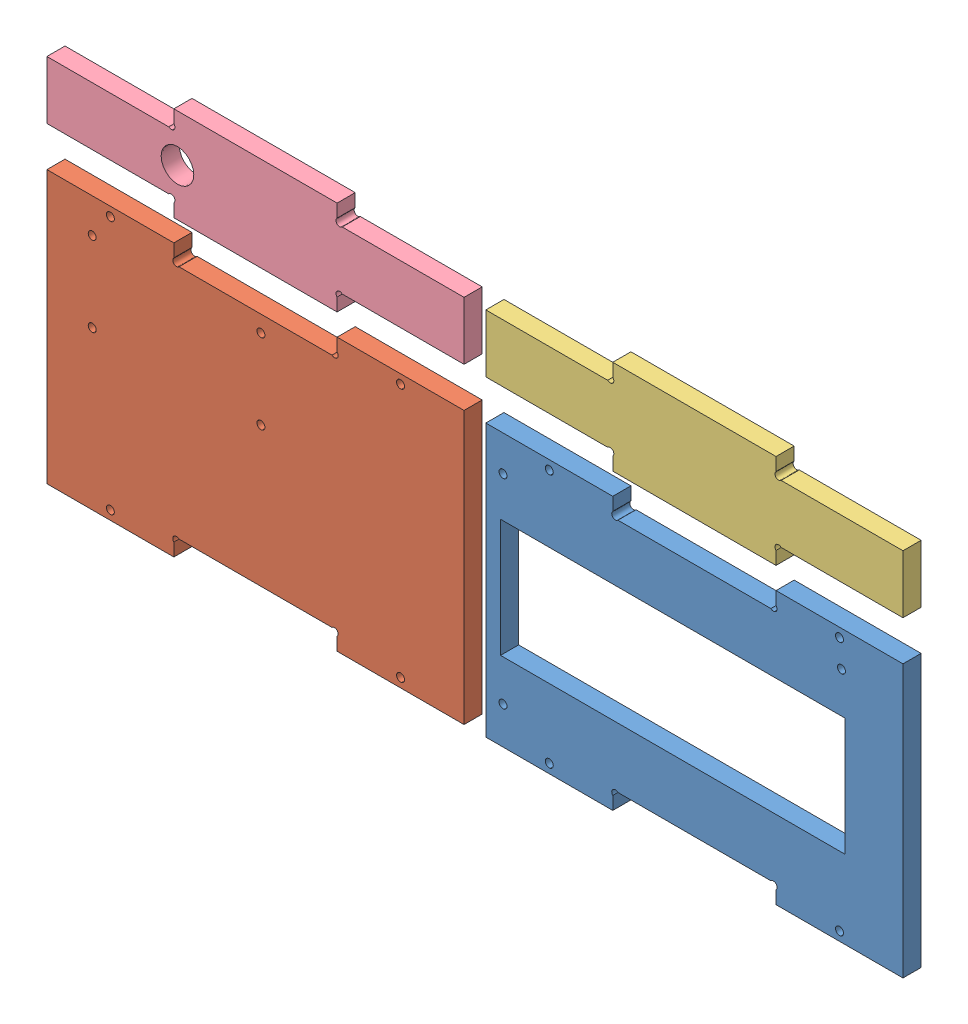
SolidWorks assembly Assemblage2.sldasm, configuration Défaut (file format 7000). Lengths in mm.
Overall size (236 107 5).
4 component instances, 4 part files, 9 mates.
Components (placement in the parent):
- cache OLED 4 lignes-1: cache OLED 4 lignes.SLDPRT [Défaut] at (-60.3623 -44.0832 112.5) size (115 75 5)
- support OLED 4 lignes-1: support OLED 4 lignes.SLDPRT [Défaut] at (-181.3623 -44.0832 112.5) size (115 75 5)
- plaque infirieur-1: plaque infirieur.SLDPRT [Défaut] at (-60.3623 36.9168 112.5) size (115 26 5)
- plaque superieur-1: plaque superieur.SLDPRT [Défaut] at (-181.3623 36.9168 112.5) size (115 26 5)
Mates (geometry in assembly coordinates):
- Coïncidente1: coincident aligned: plane of cache OLED 4 lignes-1 through (-60.3623 30.9168 112.5) normal (0 0 -1); plane of support OLED 4 lignes-1 through (-181.3623 30.9168 112.5) normal (0 0 -1)
- Coïncidente2: coincident aligned: plane of cache OLED 4 lignes-1 through (-60.3623 30.9168 112.5) normal (0 0 -1); plane of plaque infirieur-1 through (-60.3623 62.9168 112.5) normal (0 0 -1)
- Coïncidente3: coincident aligned: plane of cache OLED 4 lignes-1 through (-60.3623 30.9168 112.5) normal (0 0 -1); plane of plaque superieur-1 through (-181.3623 62.9168 112.5) normal (0 0 -1)
- Coïncidente4: coincident aligned: plane of cache OLED 4 lignes-1 through (-60.3623 -44.0832 117.5) normal (0 -1 0); plane of support OLED 4 lignes-1 through (-181.3623 -44.0832 117.5) normal (0 -1 0)
- Distance1: distance = 6 mm anti-aligned: plane of cache OLED 4 lignes-1 through (-60.3623 -44.0832 117.5) normal (-1 0 0); plane of support OLED 4 lignes-1 through (-66.3623 -44.0832 117.5) normal (1 0 0)
- Distance2: distance = 6 mm anti-aligned: plane of cache OLED 4 lignes-1 through (-60.3623 30.9168 117.5) normal (0 1 0); plane of plaque infirieur-1 through (-60.3623 36.9168 117.5) normal (0 -1 0)
- Coïncidente7: coincident aligned: plane of cache OLED 4 lignes-1 through (54.6377 -44.0832 117.5) normal (1 0 0); plane of plaque infirieur-1 through (54.6377 36.9168 117.5) normal (1 0 0)
- Coïncidente8: coincident aligned: plane of support OLED 4 lignes-1 through (-66.3623 -44.0832 117.5) normal (1 0 0); plane of plaque superieur-1 through (-66.3623 36.9168 117.5) normal (1 0 0)
- Coïncidente9: coincident aligned: plane of plaque infirieur-1 through (-60.3623 36.9168 117.5) normal (0 -1 0); plane of plaque superieur-1 through (-181.3623 36.9168 117.5) normal (0 -1 0)
